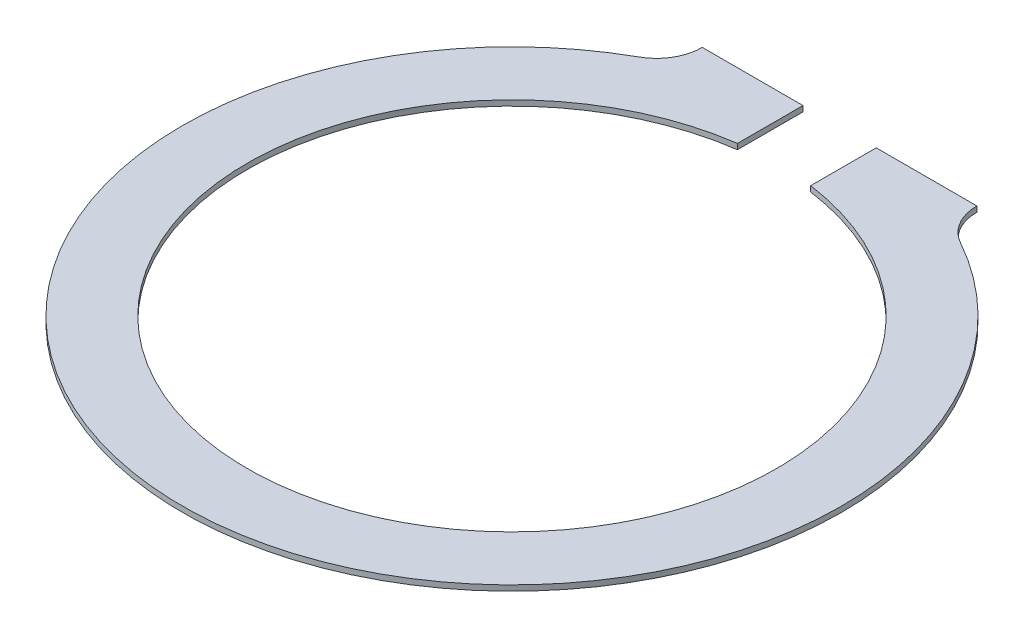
ISO-10303-21;
HEADER;
FILE_DESCRIPTION(('STEP AP214'),'2;1');
FILE_NAME('part.step','',(''),(''),'','','');
FILE_SCHEMA(('AUTOMOTIVE_DESIGN { 1 0 10303 214 1 1 1 1 }'));
ENDSEC;
DATA;
#1=APPLICATION_CONTEXT('core data for automotive mechanical design processes');
#2=APPLICATION_PROTOCOL_DEFINITION('international standard','automotive_design',2000,#1);
#3=PRODUCT_CONTEXT('',#1,'mechanical');
#4=PRODUCT('Part','Part','',(#3));
#5=PRODUCT_RELATED_PRODUCT_CATEGORY('part','',(#4));
#6=PRODUCT_DEFINITION_FORMATION('','',#4);
#7=PRODUCT_DEFINITION_CONTEXT('part definition',#1,'design');
#8=PRODUCT_DEFINITION('design','',#6,#7);
#9=PRODUCT_DEFINITION_SHAPE('','',#8);
#10=(LENGTH_UNIT() NAMED_UNIT(*) SI_UNIT(.MILLI.,.METRE.));
#11=(NAMED_UNIT(*) PLANE_ANGLE_UNIT() SI_UNIT($,.RADIAN.));
#12=(NAMED_UNIT(*) SI_UNIT($,.STERADIAN.) SOLID_ANGLE_UNIT());
#13=UNCERTAINTY_MEASURE_WITH_UNIT(LENGTH_MEASURE(1.E-05),#10,'distance_accuracy_value','');
#14=(GEOMETRIC_REPRESENTATION_CONTEXT(3) GLOBAL_UNCERTAINTY_ASSIGNED_CONTEXT((#13)) GLOBAL_UNIT_ASSIGNED_CONTEXT((#10,
#11,#12)) REPRESENTATION_CONTEXT('',''));
#15=CARTESIAN_POINT('',(0.,0.,0.));
#16=DIRECTION('',(0.,0.,1.));
#17=DIRECTION('',(1.,0.,0.));
#18=AXIS2_PLACEMENT_3D('',#15,#16,#17);
#19=CARTESIAN_POINT('',(-5.07969239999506,0.1524,-9.09110120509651));
#20=DIRECTION('',(0.,-1.,0.));
#21=DIRECTION('',(0.,0.,-1.));
#22=AXIS2_PLACEMENT_3D('',#19,#20,#21);
#23=CYLINDRICAL_SURFACE('',#22,1.26999999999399);
#24=CARTESIAN_POINT('',(-5.07969239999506,0.,-9.09110120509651));
#25=DIRECTION('',(0.,-1.,0.));
#26=DIRECTION('',(0.,0.,1.));
#27=AXIS2_PLACEMENT_3D('',#24,#25,#26);
#28=CIRCLE('',#27,1.26999999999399);
#29=CARTESIAN_POINT('',(-3.80969240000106,0.,-9.09110120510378));
#30=VERTEX_POINT('',#29);
#31=CARTESIAN_POINT('',(-4.46021771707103,0.,-7.98243032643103));
#32=VERTEX_POINT('',#31);
#33=EDGE_CURVE('E126',#30,#32,#28,.T.);
#34=ORIENTED_EDGE('',*,*,#33,.T.);
#35=DIRECTION('',(0.,-1.,0.));
#36=VECTOR('',#35,1.);
#37=CARTESIAN_POINT('',(-4.46021771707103,0.1524,-7.98243032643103));
#38=LINE('',#37,#36);
#39=CARTESIAN_POINT('',(-4.46021771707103,0.1524,-7.98243032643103));
#40=VERTEX_POINT('',#39);
#41=EDGE_CURVE('E11',#40,#32,#38,.T.);
#42=ORIENTED_EDGE('',*,*,#41,.F.);
#43=CARTESIAN_POINT('',(-5.07969239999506,0.1524,-9.09110120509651));
#44=DIRECTION('',(0.,-1.,0.));
#45=DIRECTION('',(0.,0.,1.));
#46=AXIS2_PLACEMENT_3D('',#43,#44,#45);
#47=CIRCLE('',#46,1.26999999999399);
#48=CARTESIAN_POINT('',(-3.80969240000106,0.1524,-9.09110120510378));
#49=VERTEX_POINT('',#48);
#50=EDGE_CURVE('E140',#49,#40,#47,.T.);
#51=ORIENTED_EDGE('',*,*,#50,.F.);
#52=DIRECTION('',(0.,-1.,0.));
#53=VECTOR('',#52,1.);
#54=CARTESIAN_POINT('',(-3.80969240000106,0.1524,-9.09110120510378));
#55=LINE('',#54,#53);
#56=EDGE_CURVE('E122',#49,#30,#55,.T.);
#57=ORIENTED_EDGE('',*,*,#56,.T.);
#58=EDGE_LOOP('',(#34,#42,#51,#57));
#59=FACE_BOUND('',#58,.T.);
#60=ADVANCED_FACE('F30',(#59),#23,.F.);
#61=CARTESIAN_POINT('',(0.,0.1524,0.));
#62=DIRECTION('',(0.,-1.,0.));
#63=DIRECTION('',(0.,0.,-1.));
#64=AXIS2_PLACEMENT_3D('',#61,#62,#63);
#65=CYLINDRICAL_SURFACE('',#64,9.14400000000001);
#66=CARTESIAN_POINT('',(0.,0.,0.));
#67=DIRECTION('',(0.,1.,0.));
#68=DIRECTION('',(0.,0.,1.));
#69=AXIS2_PLACEMENT_3D('',#66,#67,#68);
#70=CIRCLE('',#69,9.14400000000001);
#71=CARTESIAN_POINT('',(4.46021771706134,0.,-7.98243032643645));
#72=VERTEX_POINT('',#71);
#73=EDGE_CURVE('E129',#32,#72,#70,.T.);
#74=ORIENTED_EDGE('',*,*,#73,.T.);
#75=DIRECTION('',(0.,-1.,0.));
#76=VECTOR('',#75,1.);
#77=CARTESIAN_POINT('',(4.46021771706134,0.1524,-7.98243032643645));
#78=LINE('',#77,#76);
#79=CARTESIAN_POINT('',(4.46021771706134,0.1524,-7.98243032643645));
#80=VERTEX_POINT('',#79);
#81=EDGE_CURVE('E38',#80,#72,#78,.T.);
#82=ORIENTED_EDGE('',*,*,#81,.F.);
#83=CARTESIAN_POINT('',(0.,0.1524,0.));
#84=DIRECTION('',(0.,1.,0.));
#85=DIRECTION('',(0.,0.,1.));
#86=AXIS2_PLACEMENT_3D('',#83,#84,#85);
#87=CIRCLE('',#86,9.14400000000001);
#88=EDGE_CURVE('E89',#40,#80,#87,.T.);
#89=ORIENTED_EDGE('',*,*,#88,.F.);
#90=ORIENTED_EDGE('',*,*,#41,.T.);
#91=EDGE_LOOP('',(#74,#82,#89,#90));
#92=FACE_BOUND('',#91,.T.);
#93=ADVANCED_FACE('F175',(#92),#65,.T.);
#94=CARTESIAN_POINT('',(5.07969239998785,0.1524,-9.09110120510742));
#95=DIRECTION('',(0.,-1.,0.));
#96=DIRECTION('',(0.,0.,-1.));
#97=AXIS2_PLACEMENT_3D('',#94,#95,#96);
#98=CYLINDRICAL_SURFACE('',#97,1.26999999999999);
#99=CARTESIAN_POINT('',(5.07969239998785,0.,-9.09110120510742));
#100=DIRECTION('',(0.,-1.,0.));
#101=DIRECTION('',(0.,0.,1.));
#102=AXIS2_PLACEMENT_3D('',#99,#100,#101);
#103=CIRCLE('',#102,1.26999999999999);
#104=CARTESIAN_POINT('',(3.80969239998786,0.,-9.09110120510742));
#105=VERTEX_POINT('',#104);
#106=EDGE_CURVE('E131',#72,#105,#103,.T.);
#107=ORIENTED_EDGE('',*,*,#106,.T.);
#108=DIRECTION('',(0.,-1.,0.));
#109=VECTOR('',#108,1.);
#110=CARTESIAN_POINT('',(3.80969239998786,0.1524,-9.09110120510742));
#111=LINE('',#110,#109);
#112=CARTESIAN_POINT('',(3.80969239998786,0.1524,-9.09110120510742));
#113=VERTEX_POINT('',#112);
#114=EDGE_CURVE('E147',#113,#105,#111,.T.);
#115=ORIENTED_EDGE('',*,*,#114,.F.);
#116=CARTESIAN_POINT('',(5.07969239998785,0.1524,-9.09110120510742));
#117=DIRECTION('',(0.,-1.,0.));
#118=DIRECTION('',(0.,0.,1.));
#119=AXIS2_PLACEMENT_3D('',#116,#117,#118);
#120=CIRCLE('',#119,1.26999999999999);
#121=EDGE_CURVE('E155',#80,#113,#120,.T.);
#122=ORIENTED_EDGE('',*,*,#121,.F.);
#123=ORIENTED_EDGE('',*,*,#81,.T.);
#124=EDGE_LOOP('',(#107,#115,#122,#123));
#125=FACE_BOUND('',#124,.T.);
#126=ADVANCED_FACE('F153',(#125),#98,.F.);
#127=CARTESIAN_POINT('',(3.80969239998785,0.1524,-9.09110120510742));
#128=DIRECTION('',(0.,0.,1.));
#129=DIRECTION('',(1.,0.,0.));
#130=AXIS2_PLACEMENT_3D('',#127,#128,#129);
#131=PLANE('',#130);
#132=DIRECTION('',(-1.,0.,0.));
#133=VECTOR('',#132,1.);
#134=CARTESIAN_POINT('',(3.80969239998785,0.,-9.09110120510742));
#135=LINE('',#134,#133);
#136=CARTESIAN_POINT('',(1.01600000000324,0.,-9.09110120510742));
#137=VERTEX_POINT('',#136);
#138=EDGE_CURVE('E133',#105,#137,#135,.T.);
#139=ORIENTED_EDGE('',*,*,#138,.T.);
#140=DIRECTION('',(0.,-1.,0.));
#141=VECTOR('',#140,1.);
#142=CARTESIAN_POINT('',(1.01600000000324,0.1524,-9.09110120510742));
#143=LINE('',#142,#141);
#144=CARTESIAN_POINT('',(1.01600000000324,0.1524,-9.09110120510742));
#145=VERTEX_POINT('',#144);
#146=EDGE_CURVE('E144',#145,#137,#143,.T.);
#147=ORIENTED_EDGE('',*,*,#146,.F.);
#148=DIRECTION('',(-1.,0.,0.));
#149=VECTOR('',#148,1.);
#150=CARTESIAN_POINT('',(3.80969239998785,0.1524,-9.09110120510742));
#151=LINE('',#150,#149);
#152=EDGE_CURVE('E167',#113,#145,#151,.T.);
#153=ORIENTED_EDGE('',*,*,#152,.F.);
#154=ORIENTED_EDGE('',*,*,#114,.T.);
#155=EDGE_LOOP('',(#139,#147,#153,#154));
#156=FACE_BOUND('',#155,.T.);
#157=ADVANCED_FACE('F163',(#156),#131,.F.);
#158=CARTESIAN_POINT('',(1.01600000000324,0.1524,-7.27155150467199));
#159=DIRECTION('',(1.,0.,0.));
#160=DIRECTION('',(0.,0.,-1.));
#161=AXIS2_PLACEMENT_3D('',#158,#159,#160);
#162=PLANE('',#161);
#163=DIRECTION('',(0.,0.,1.));
#164=VECTOR('',#163,1.);
#165=CARTESIAN_POINT('',(1.01600000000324,0.,-7.27155150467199));
#166=LINE('',#165,#164);
#167=CARTESIAN_POINT('',(1.01600000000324,0.,-7.27155150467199));
#168=VERTEX_POINT('',#167);
#169=EDGE_CURVE('E135',#137,#168,#166,.T.);
#170=ORIENTED_EDGE('',*,*,#169,.T.);
#171=DIRECTION('',(0.,-1.,0.));
#172=VECTOR('',#171,1.);
#173=CARTESIAN_POINT('',(1.01600000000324,0.1524,-7.27155150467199));
#174=LINE('',#173,#172);
#175=CARTESIAN_POINT('',(1.01600000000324,0.1524,-7.27155150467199));
#176=VERTEX_POINT('',#175);
#177=EDGE_CURVE('E117',#176,#168,#174,.T.);
#178=ORIENTED_EDGE('',*,*,#177,.F.);
#179=DIRECTION('',(0.,0.,1.));
#180=VECTOR('',#179,1.);
#181=CARTESIAN_POINT('',(1.01600000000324,0.1524,-7.27155150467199));
#182=LINE('',#181,#180);
#183=EDGE_CURVE('E108',#145,#176,#182,.T.);
#184=ORIENTED_EDGE('',*,*,#183,.F.);
#185=ORIENTED_EDGE('',*,*,#146,.T.);
#186=EDGE_LOOP('',(#170,#178,#184,#185));
#187=FACE_BOUND('',#186,.T.);
#188=ADVANCED_FACE('F166',(#187),#162,.F.);
#189=CARTESIAN_POINT('',(0.,0.1524,0.));
#190=DIRECTION('',(0.,-1.,0.));
#191=DIRECTION('',(0.,0.,-1.));
#192=AXIS2_PLACEMENT_3D('',#189,#190,#191);
#193=CYLINDRICAL_SURFACE('',#192,7.34218749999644);
#194=CARTESIAN_POINT('',(0.,0.,0.));
#195=DIRECTION('',(0.,-1.,0.));
#196=DIRECTION('',(0.,0.,1.));
#197=AXIS2_PLACEMENT_3D('',#194,#195,#196);
#198=CIRCLE('',#197,7.34218749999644);
#199=CARTESIAN_POINT('',(-1.01599999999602,0.,-7.27155150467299));
#200=VERTEX_POINT('',#199);
#201=EDGE_CURVE('E116',#168,#200,#198,.T.);
#202=ORIENTED_EDGE('',*,*,#201,.T.);
#203=DIRECTION('',(0.,-1.,0.));
#204=VECTOR('',#203,1.);
#205=CARTESIAN_POINT('',(-1.01599999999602,0.1524,-7.27155150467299));
#206=LINE('',#205,#204);
#207=CARTESIAN_POINT('',(-1.01599999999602,0.1524,-7.27155150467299));
#208=VERTEX_POINT('',#207);
#209=EDGE_CURVE('E113',#208,#200,#206,.T.);
#210=ORIENTED_EDGE('',*,*,#209,.F.);
#211=CARTESIAN_POINT('',(0.,0.1524,0.));
#212=DIRECTION('',(0.,-1.,0.));
#213=DIRECTION('',(0.,0.,1.));
#214=AXIS2_PLACEMENT_3D('',#211,#212,#213);
#215=CIRCLE('',#214,7.34218749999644);
#216=EDGE_CURVE('E102',#176,#208,#215,.T.);
#217=ORIENTED_EDGE('',*,*,#216,.F.);
#218=ORIENTED_EDGE('',*,*,#177,.T.);
#219=EDGE_LOOP('',(#202,#210,#217,#218));
#220=FACE_BOUND('',#219,.T.);
#221=ADVANCED_FACE('F114',(#220),#193,.F.);
#222=CARTESIAN_POINT('',(-1.01599999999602,0.1524,-7.27155150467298));
#223=DIRECTION('',(-1.,0.,0.));
#224=DIRECTION('',(0.,0.,1.));
#225=AXIS2_PLACEMENT_3D('',#222,#223,#224);
#226=PLANE('',#225);
#227=DIRECTION('',(0.,0.,-1.));
#228=VECTOR('',#227,1.);
#229=CARTESIAN_POINT('',(-1.01599999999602,0.,-7.27155150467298));
#230=LINE('',#229,#228);
#231=CARTESIAN_POINT('',(-1.01599999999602,0.,-9.09110120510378));
#232=VERTEX_POINT('',#231);
#233=EDGE_CURVE('E75',#200,#232,#230,.T.);
#234=ORIENTED_EDGE('',*,*,#233,.T.);
#235=DIRECTION('',(0.,-1.,0.));
#236=VECTOR('',#235,1.);
#237=CARTESIAN_POINT('',(-1.01599999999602,0.1524,-9.09110120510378));
#238=LINE('',#237,#236);
#239=CARTESIAN_POINT('',(-1.01599999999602,0.1524,-9.09110120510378));
#240=VERTEX_POINT('',#239);
#241=EDGE_CURVE('E118',#240,#232,#238,.T.);
#242=ORIENTED_EDGE('',*,*,#241,.F.);
#243=DIRECTION('',(0.,0.,-1.));
#244=VECTOR('',#243,1.);
#245=CARTESIAN_POINT('',(-1.01599999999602,0.1524,-7.27155150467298));
#246=LINE('',#245,#244);
#247=EDGE_CURVE('E106',#208,#240,#246,.T.);
#248=ORIENTED_EDGE('',*,*,#247,.F.);
#249=ORIENTED_EDGE('',*,*,#209,.T.);
#250=EDGE_LOOP('',(#234,#242,#248,#249));
#251=FACE_BOUND('',#250,.T.);
#252=ADVANCED_FACE('F120',(#251),#226,.F.);
#253=CARTESIAN_POINT('',(-1.01599999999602,0.1524,-9.09110120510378));
#254=DIRECTION('',(0.,0.,1.));
#255=DIRECTION('',(1.,0.,0.));
#256=AXIS2_PLACEMENT_3D('',#253,#254,#255);
#257=PLANE('',#256);
#258=DIRECTION('',(-1.,0.,0.));
#259=VECTOR('',#258,1.);
#260=CARTESIAN_POINT('',(-1.01599999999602,0.,-9.09110120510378));
#261=LINE('',#260,#259);
#262=EDGE_CURVE('E81',#232,#30,#261,.T.);
#263=ORIENTED_EDGE('',*,*,#262,.T.);
#264=ORIENTED_EDGE('',*,*,#56,.F.);
#265=DIRECTION('',(-1.,0.,0.));
#266=VECTOR('',#265,1.);
#267=CARTESIAN_POINT('',(-1.01599999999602,0.1524,-9.09110120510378));
#268=LINE('',#267,#266);
#269=EDGE_CURVE('E46',#240,#49,#268,.T.);
#270=ORIENTED_EDGE('',*,*,#269,.F.);
#271=ORIENTED_EDGE('',*,*,#241,.T.);
#272=EDGE_LOOP('',(#263,#264,#270,#271));
#273=FACE_BOUND('',#272,.T.);
#274=ADVANCED_FACE('F191',(#273),#257,.F.);
#275=CARTESIAN_POINT('',(-5.07969239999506,0.1524,-9.09110120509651));
#276=DIRECTION('',(0.,1.,0.));
#277=DIRECTION('',(0.,0.,1.));
#278=AXIS2_PLACEMENT_3D('',#275,#276,#277);
#279=PLANE('',#278);
#280=ORIENTED_EDGE('',*,*,#50,.T.);
#281=ORIENTED_EDGE('',*,*,#88,.T.);
#282=ORIENTED_EDGE('',*,*,#121,.T.);
#283=ORIENTED_EDGE('',*,*,#152,.T.);
#284=ORIENTED_EDGE('',*,*,#183,.T.);
#285=ORIENTED_EDGE('',*,*,#216,.T.);
#286=ORIENTED_EDGE('',*,*,#247,.T.);
#287=ORIENTED_EDGE('',*,*,#269,.T.);
#288=EDGE_LOOP('',(#280,#281,#282,#283,#284,#285,#286,#287));
#289=FACE_BOUND('',#288,.T.);
#290=ADVANCED_FACE('F104',(#289),#279,.T.);
#291=CARTESIAN_POINT('',(-5.07969239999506,0.,-9.09110120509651));
#292=DIRECTION('',(0.,1.,0.));
#293=DIRECTION('',(0.,0.,1.));
#294=AXIS2_PLACEMENT_3D('',#291,#292,#293);
#295=PLANE('',#294);
#296=ORIENTED_EDGE('',*,*,#33,.F.);
#297=ORIENTED_EDGE('',*,*,#262,.F.);
#298=ORIENTED_EDGE('',*,*,#233,.F.);
#299=ORIENTED_EDGE('',*,*,#201,.F.);
#300=ORIENTED_EDGE('',*,*,#169,.F.);
#301=ORIENTED_EDGE('',*,*,#138,.F.);
#302=ORIENTED_EDGE('',*,*,#106,.F.);
#303=ORIENTED_EDGE('',*,*,#73,.F.);
#304=EDGE_LOOP('',(#296,#297,#298,#299,#300,#301,#302,#303));
#305=FACE_BOUND('',#304,.T.);
#306=ADVANCED_FACE('F159',(#305),#295,.F.);
#307=CLOSED_SHELL('',(#60,#93,#126,#157,#188,#221,#252,#274,#290,#306));
#308=MANIFOLD_SOLID_BREP('B2',#307);
#309=ADVANCED_BREP_SHAPE_REPRESENTATION('',(#18,#308),#14);
#310=SHAPE_DEFINITION_REPRESENTATION(#9,#309);
ENDSEC;
END-ISO-10303-21;
